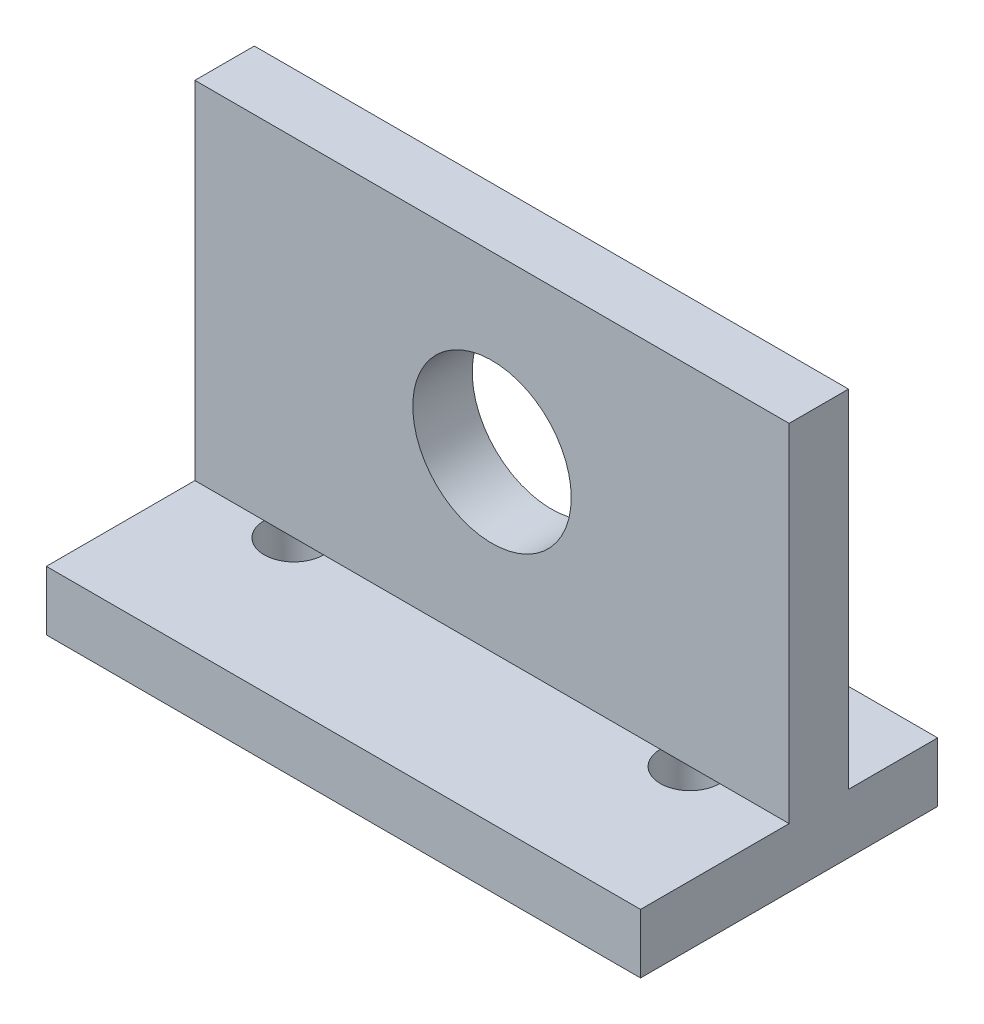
from build123d import *

# Parameters (mm, degrees)
SKETCH_1_W          = 120
SKETCH_1_H          = 60
EXTRUDE_1_DEPTH     = 12
SKETCH_2_W          = 120
SKETCH_2_H          = 70
EXTRUDE_2_DEPTH     = 12
SKETCH_3_R          = 6
CUT_EXTRUDE_1_DEPTH = 12
SKETCH_4_R          = 6
CUT_EXTRUDE_2_DEPTH = 12
SKETCH_5_R          = 16
CUT_EXTRUDE_3_DEPTH = 12


with BuildPart() as part:
    # Sketch 1 → Extrude 1 (new body)
    with BuildSketch(Plane(origin=(0, 0, 0), x_dir=(1, 0, 0), z_dir=(0, 1, 0))):
        Rectangle(SKETCH_1_W, SKETCH_1_H)
    extrude(amount=-EXTRUDE_1_DEPTH)

    # Sketch 2 → Extrude 2 (add)
    with BuildSketch(Plane.XY):
        with Locations((0, 35)):
            Rectangle(SKETCH_2_W, SKETCH_2_H)
    extrude(amount=-EXTRUDE_2_DEPTH)

    # Sketch 3 → Cut-Extrude 1 (cut)
    with BuildSketch(Plane(origin=(0, 0, 0), x_dir=(1, 0, 0), z_dir=(0, 1, 0))):
        with Locations(Location((40, 0, 0), (0, 0, 270))):
            Circle(SKETCH_3_R)
    extrude(amount=-CUT_EXTRUDE_1_DEPTH, mode=Mode.SUBTRACT)

    # Sketch 4 → Cut-Extrude 2 (cut)
    with BuildSketch(Plane(origin=(0, 0, 0), x_dir=(1, 0, 0), z_dir=(0, 1, 0))):
        with Locations(Location((-40, 0, 0), (0, 0, 270))):
            Circle(SKETCH_4_R)
    extrude(amount=-CUT_EXTRUDE_2_DEPTH, mode=Mode.SUBTRACT)

    # Sketch 5 → Cut-Extrude 3 (cut)
    with BuildSketch(Plane.XY):
        with Locations((0, 35)):
            Circle(SKETCH_5_R)
    extrude(amount=-CUT_EXTRUDE_3_DEPTH, mode=Mode.SUBTRACT)


solid = part.part
